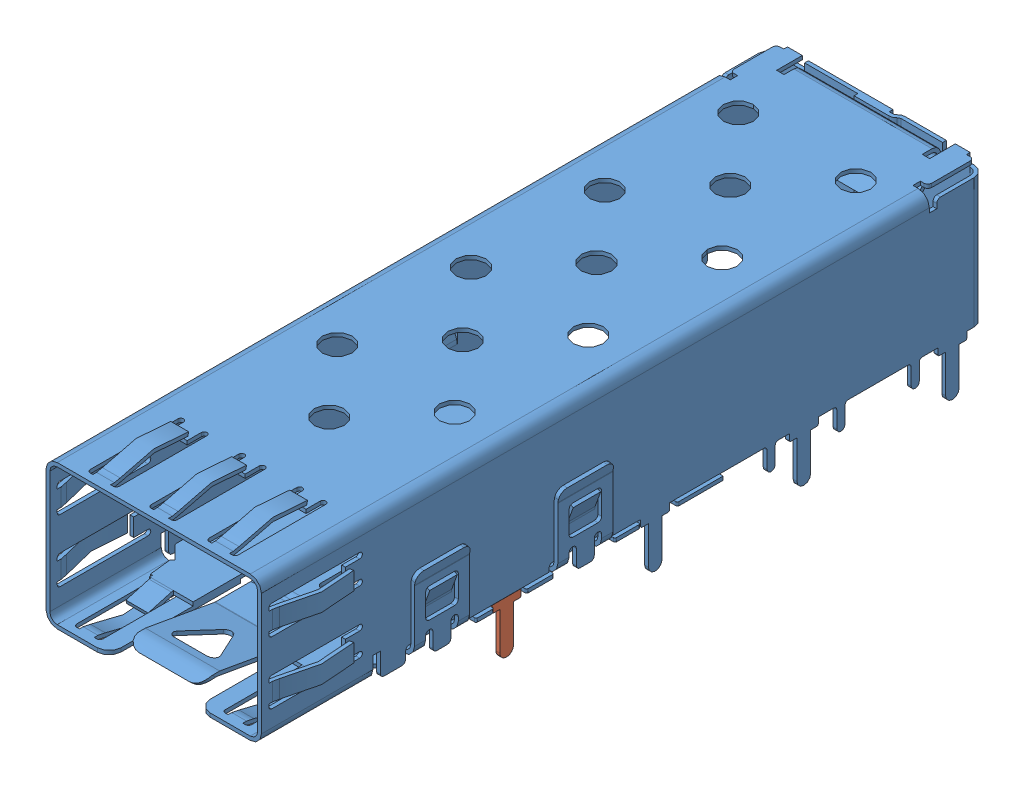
SolidWorks assembly 10341_Temp.SLDASM, configuration Default (file format 4100). Lengths in mm.
Overall size (15.84 13.38 48.8).
3 component instances, 3 part files, 0 mates.
Components (placement in the parent):
- 10341_01-1: 10341_01.SLDPRT [Default] at origin size (15.84 13.38 48.8)
- 10341_02-1: 10341_02.SLDPRT [Default] at origin size (0.25 3.5 1.95)
- 10341_03-1: 10341_03.SLDPRT [Default] at origin size (0.25 3.5 1.97)
